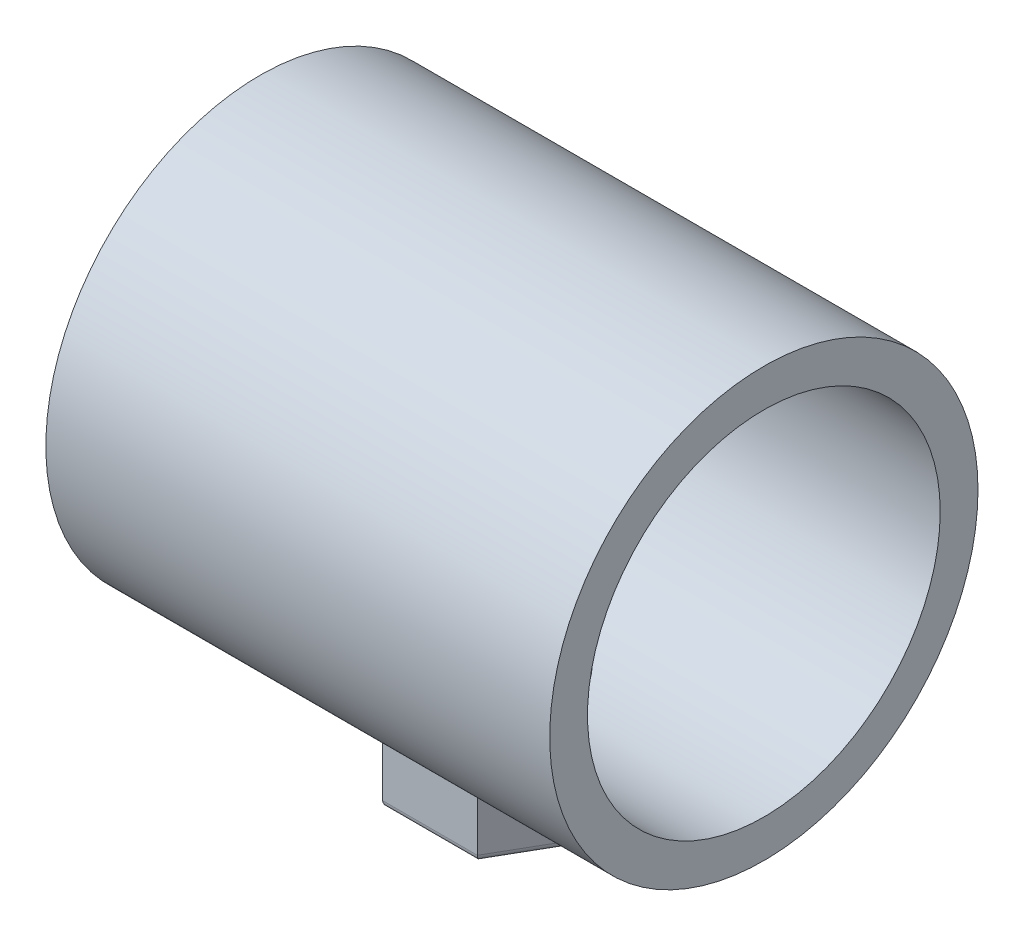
ISO-10303-21;
HEADER;
FILE_DESCRIPTION(('STEP AP214'),'2;1');
FILE_NAME('part.step','',(''),(''),'','','');
FILE_SCHEMA(('AUTOMOTIVE_DESIGN { 1 0 10303 214 1 1 1 1 }'));
ENDSEC;
DATA;
#1=APPLICATION_CONTEXT('core data for automotive mechanical design processes');
#2=APPLICATION_PROTOCOL_DEFINITION('international standard','automotive_design',2000,#1);
#3=PRODUCT_CONTEXT('',#1,'mechanical');
#4=PRODUCT('Part','Part','',(#3));
#5=PRODUCT_RELATED_PRODUCT_CATEGORY('part','',(#4));
#6=PRODUCT_DEFINITION_FORMATION('','',#4);
#7=PRODUCT_DEFINITION_CONTEXT('part definition',#1,'design');
#8=PRODUCT_DEFINITION('design','',#6,#7);
#9=PRODUCT_DEFINITION_SHAPE('','',#8);
#10=(LENGTH_UNIT() NAMED_UNIT(*) SI_UNIT(.MILLI.,.METRE.));
#11=(NAMED_UNIT(*) PLANE_ANGLE_UNIT() SI_UNIT($,.RADIAN.));
#12=(NAMED_UNIT(*) SI_UNIT($,.STERADIAN.) SOLID_ANGLE_UNIT());
#13=UNCERTAINTY_MEASURE_WITH_UNIT(LENGTH_MEASURE(1.E-05),#10,'distance_accuracy_value','');
#14=(GEOMETRIC_REPRESENTATION_CONTEXT(3) GLOBAL_UNCERTAINTY_ASSIGNED_CONTEXT((#13)) GLOBAL_UNIT_ASSIGNED_CONTEXT((#10,
#11,#12)) REPRESENTATION_CONTEXT('',''));
#15=CARTESIAN_POINT('',(0.,0.,0.));
#16=DIRECTION('',(0.,0.,1.));
#17=DIRECTION('',(1.,0.,0.));
#18=AXIS2_PLACEMENT_3D('',#15,#16,#17);
#19=CARTESIAN_POINT('',(23.7583426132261,-17.,6.5));
#20=DIRECTION('',(0.,1.,0.));
#21=DIRECTION('',(0.,0.,1.));
#22=AXIS2_PLACEMENT_3D('',#19,#20,#21);
#23=PLANE('',#22);
#24=DIRECTION('',(-0.498887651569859,0.,0.866666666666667));
#25=VECTOR('',#24,1.);
#26=CARTESIAN_POINT('',(12.9333333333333,-17.,0.249443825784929));
#27=LINE('',#26,#25);
#28=CARTESIAN_POINT('',(16.5307606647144,-17.,-6.));
#29=VERTEX_POINT('',#28);
#30=CARTESIAN_POINT('',(13.0769230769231,-17.,0.));
#31=VERTEX_POINT('',#30);
#32=EDGE_CURVE('E46',#29,#31,#27,.T.);
#33=ORIENTED_EDGE('',*,*,#32,.T.);
#34=DIRECTION('',(0.498887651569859,0.,0.866666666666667));
#35=VECTOR('',#34,1.);
#36=CARTESIAN_POINT('',(16.6749907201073,-17.,6.25055617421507));
#37=LINE('',#36,#35);
#38=CARTESIAN_POINT('',(16.5307606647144,-17.,6.));
#39=VERTEX_POINT('',#38);
#40=EDGE_CURVE('E12',#31,#39,#37,.T.);
#41=ORIENTED_EDGE('',*,*,#40,.T.);
#42=DIRECTION('',(1.,0.,0.));
#43=VECTOR('',#42,1.);
#44=CARTESIAN_POINT('',(23.7583426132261,-17.,6.));
#45=LINE('',#44,#43);
#46=CARTESIAN_POINT('',(23.4692393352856,-17.,6.));
#47=VERTEX_POINT('',#46);
#48=EDGE_CURVE('E160',#39,#47,#45,.T.);
#49=ORIENTED_EDGE('',*,*,#48,.T.);
#50=DIRECTION('',(0.498887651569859,0.,-0.866666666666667));
#51=VECTOR('',#50,1.);
#52=CARTESIAN_POINT('',(27.0666666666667,-17.,-0.249443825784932));
#53=LINE('',#52,#51);
#54=CARTESIAN_POINT('',(26.9230769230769,-17.,0.));
#55=VERTEX_POINT('',#54);
#56=EDGE_CURVE('E238',#47,#55,#53,.T.);
#57=ORIENTED_EDGE('',*,*,#56,.T.);
#58=DIRECTION('',(-0.498887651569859,0.,-0.866666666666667));
#59=VECTOR('',#58,1.);
#60=CARTESIAN_POINT('',(23.3250092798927,-17.,-6.25055617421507));
#61=LINE('',#60,#59);
#62=CARTESIAN_POINT('',(23.4692393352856,-17.,-6.));
#63=VERTEX_POINT('',#62);
#64=EDGE_CURVE('E240',#55,#63,#61,.T.);
#65=ORIENTED_EDGE('',*,*,#64,.T.);
#66=DIRECTION('',(-1.,0.,0.));
#67=VECTOR('',#66,1.);
#68=CARTESIAN_POINT('',(16.2416573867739,-17.,-6.));
#69=LINE('',#68,#67);
#70=EDGE_CURVE('E56',#63,#29,#69,.T.);
#71=ORIENTED_EDGE('',*,*,#70,.T.);
#72=EDGE_LOOP('',(#33,#41,#49,#57,#65,#71));
#73=FACE_BOUND('',#72,.T.);
#74=CARTESIAN_POINT('',(20.,-17.,0.));
#75=DIRECTION('',(0.,1.,0.));
#76=DIRECTION('',(0.,0.,1.));
#77=AXIS2_PLACEMENT_3D('',#74,#75,#76);
#78=CIRCLE('',#77,3.4);
#79=CARTESIAN_POINT('',(20.,-17.,3.4));
#80=VERTEX_POINT('',#79);
#81=EDGE_CURVE('E149',#80,#80,#78,.T.);
#82=ORIENTED_EDGE('',*,*,#81,.F.);
#83=EDGE_LOOP('',(#82));
#84=FACE_BOUND('',#83,.T.);
#85=ADVANCED_FACE('F38',(#73,#84),#23,.T.);
#86=CARTESIAN_POINT('',(23.7583426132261,-22.,6.5));
#87=DIRECTION('',(0.,1.,0.));
#88=DIRECTION('',(0.,0.,1.));
#89=AXIS2_PLACEMENT_3D('',#86,#87,#88);
#90=PLANE('',#89);
#91=DIRECTION('',(1.,0.,0.));
#92=VECTOR('',#91,1.);
#93=CARTESIAN_POINT('',(23.7583426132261,-22.,6.));
#94=LINE('',#93,#92);
#95=CARTESIAN_POINT('',(23.4692393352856,-22.,6.));
#96=VERTEX_POINT('',#95);
#97=CARTESIAN_POINT('',(16.5307606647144,-22.,6.));
#98=VERTEX_POINT('',#97);
#99=EDGE_CURVE('E208',#96,#98,#94,.F.);
#100=ORIENTED_EDGE('',*,*,#99,.T.);
#101=DIRECTION('',(0.498887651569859,0.,0.866666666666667));
#102=VECTOR('',#101,1.);
#103=CARTESIAN_POINT('',(18.5458101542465,-22.,9.50054008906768));
#104=LINE('',#103,#102);
#105=CARTESIAN_POINT('',(13.0769230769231,-22.,0.));
#106=VERTEX_POINT('',#105);
#107=EDGE_CURVE('E218',#98,#106,#104,.F.);
#108=ORIENTED_EDGE('',*,*,#107,.T.);
#109=DIRECTION('',(-0.498887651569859,0.,0.866666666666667));
#110=VECTOR('',#109,1.);
#111=CARTESIAN_POINT('',(12.9250092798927,-22.,0.263904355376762));
#112=LINE('',#111,#110);
#113=CARTESIAN_POINT('',(16.5307606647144,-22.,-5.99999999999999));
#114=VERTEX_POINT('',#113);
#115=EDGE_CURVE('E216',#106,#114,#112,.F.);
#116=ORIENTED_EDGE('',*,*,#115,.T.);
#117=DIRECTION('',(-1.,0.,0.));
#118=VECTOR('',#117,1.);
#119=CARTESIAN_POINT('',(23.7583426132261,-22.,-6.));
#120=LINE('',#119,#118);
#121=CARTESIAN_POINT('',(23.4692393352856,-22.,-5.99999999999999));
#122=VERTEX_POINT('',#121);
#123=EDGE_CURVE('E214',#114,#122,#120,.F.);
#124=ORIENTED_EDGE('',*,*,#123,.T.);
#125=DIRECTION('',(-0.498887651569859,0.,-0.866666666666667));
#126=VECTOR('',#125,1.);
#127=CARTESIAN_POINT('',(28.9458101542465,-22.,3.51388827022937));
#128=LINE('',#127,#126);
#129=CARTESIAN_POINT('',(26.9230769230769,-22.,0.));
#130=VERTEX_POINT('',#129);
#131=EDGE_CURVE('E212',#122,#130,#128,.F.);
#132=ORIENTED_EDGE('',*,*,#131,.T.);
#133=DIRECTION('',(0.498887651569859,0.,-0.866666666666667));
#134=VECTOR('',#133,1.);
#135=CARTESIAN_POINT('',(23.3250092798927,-22.,6.25055617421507));
#136=LINE('',#135,#134);
#137=EDGE_CURVE('E210',#130,#96,#136,.F.);
#138=ORIENTED_EDGE('',*,*,#137,.T.);
#139=EDGE_LOOP('',(#100,#108,#116,#124,#132,#138));
#140=FACE_BOUND('',#139,.T.);
#141=CARTESIAN_POINT('',(20.,-22.,0.));
#142=DIRECTION('',(0.,1.,0.));
#143=DIRECTION('',(0.,0.,1.));
#144=AXIS2_PLACEMENT_3D('',#141,#142,#143);
#145=CIRCLE('',#144,3.4);
#146=CARTESIAN_POINT('',(20.,-22.,3.4));
#147=VERTEX_POINT('',#146);
#148=EDGE_CURVE('E191',#147,#147,#145,.T.);
#149=ORIENTED_EDGE('',*,*,#148,.T.);
#150=EDGE_LOOP('',(#149));
#151=FACE_BOUND('',#150,.T.);
#152=ADVANCED_FACE('F278',(#140,#151),#90,.F.);
#153=CARTESIAN_POINT('',(16.2416573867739,-17.,6.5));
#154=DIRECTION('',(0.,0.,-1.));
#155=DIRECTION('',(-1.,0.,0.));
#156=AXIS2_PLACEMENT_3D('',#153,#154,#155);
#157=PLANE('',#156);
#158=DIRECTION('',(0.,-1.,0.));
#159=VECTOR('',#158,1.);
#160=CARTESIAN_POINT('',(16.2416573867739,-17.,6.5));
#161=LINE('',#160,#159);
#162=CARTESIAN_POINT('',(16.2416573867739,-17.5,6.5));
#163=VERTEX_POINT('',#162);
#164=CARTESIAN_POINT('',(16.2416573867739,-21.5,6.5));
#165=VERTEX_POINT('',#164);
#166=EDGE_CURVE('E128',#163,#165,#161,.T.);
#167=ORIENTED_EDGE('',*,*,#166,.T.);
#168=DIRECTION('',(1.,0.,0.));
#169=VECTOR('',#168,1.);
#170=CARTESIAN_POINT('',(16.2416573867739,-21.5,6.5));
#171=LINE('',#170,#169);
#172=CARTESIAN_POINT('',(23.7583426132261,-21.5,6.5));
#173=VERTEX_POINT('',#172);
#174=EDGE_CURVE('E135',#165,#173,#171,.T.);
#175=ORIENTED_EDGE('',*,*,#174,.T.);
#176=DIRECTION('',(0.,-1.,0.));
#177=VECTOR('',#176,1.);
#178=CARTESIAN_POINT('',(23.7583426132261,-17.,6.5));
#179=LINE('',#178,#177);
#180=CARTESIAN_POINT('',(23.7583426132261,-17.5,6.5));
#181=VERTEX_POINT('',#180);
#182=EDGE_CURVE('E130',#181,#173,#179,.T.);
#183=ORIENTED_EDGE('',*,*,#182,.F.);
#184=DIRECTION('',(1.,0.,0.));
#185=VECTOR('',#184,1.);
#186=CARTESIAN_POINT('',(16.2416573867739,-17.5,6.5));
#187=LINE('',#186,#185);
#188=EDGE_CURVE('E126',#181,#163,#187,.F.);
#189=ORIENTED_EDGE('',*,*,#188,.T.);
#190=EDGE_LOOP('',(#167,#175,#183,#189));
#191=FACE_BOUND('',#190,.T.);
#192=ADVANCED_FACE('F40',(#191),#157,.F.);
#193=CARTESIAN_POINT('',(23.7583426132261,-17.,6.5));
#194=DIRECTION('',(-0.866666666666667,0.,-0.498887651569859));
#195=DIRECTION('',(-0.498887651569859,0.,0.866666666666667));
#196=AXIS2_PLACEMENT_3D('',#193,#194,#195);
#197=PLANE('',#196);
#198=ORIENTED_EDGE('',*,*,#182,.T.);
#199=DIRECTION('',(0.498887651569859,0.,-0.866666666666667));
#200=VECTOR('',#199,1.);
#201=CARTESIAN_POINT('',(23.7583426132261,-21.5,6.5));
#202=LINE('',#201,#200);
#203=CARTESIAN_POINT('',(27.5,-21.5,0.));
#204=VERTEX_POINT('',#203);
#205=EDGE_CURVE('E136',#173,#204,#202,.T.);
#206=ORIENTED_EDGE('',*,*,#205,.T.);
#207=DIRECTION('',(0.,-1.,0.));
#208=VECTOR('',#207,1.);
#209=CARTESIAN_POINT('',(27.5,-17.,0.));
#210=LINE('',#209,#208);
#211=CARTESIAN_POINT('',(27.5,-17.5,0.));
#212=VERTEX_POINT('',#211);
#213=EDGE_CURVE('E203',#212,#204,#210,.T.);
#214=ORIENTED_EDGE('',*,*,#213,.F.);
#215=DIRECTION('',(0.498887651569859,0.,-0.866666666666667));
#216=VECTOR('',#215,1.);
#217=CARTESIAN_POINT('',(23.7583426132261,-17.5,6.5));
#218=LINE('',#217,#216);
#219=EDGE_CURVE('E233',#212,#181,#218,.F.);
#220=ORIENTED_EDGE('',*,*,#219,.T.);
#221=EDGE_LOOP('',(#198,#206,#214,#220));
#222=FACE_BOUND('',#221,.T.);
#223=ADVANCED_FACE('F260',(#222),#197,.F.);
#224=CARTESIAN_POINT('',(23.7583426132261,-17.,-6.5));
#225=DIRECTION('',(-0.866666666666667,0.,0.498887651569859));
#226=DIRECTION('',(0.498887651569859,0.,0.866666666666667));
#227=AXIS2_PLACEMENT_3D('',#224,#225,#226);
#228=PLANE('',#227);
#229=ORIENTED_EDGE('',*,*,#213,.T.);
#230=DIRECTION('',(-0.498887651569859,0.,-0.866666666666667));
#231=VECTOR('',#230,1.);
#232=CARTESIAN_POINT('',(23.7583426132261,-21.5,-6.5));
#233=LINE('',#232,#231);
#234=CARTESIAN_POINT('',(23.7583426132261,-21.5,-6.5));
#235=VERTEX_POINT('',#234);
#236=EDGE_CURVE('E231',#204,#235,#233,.T.);
#237=ORIENTED_EDGE('',*,*,#236,.T.);
#238=DIRECTION('',(0.,-1.,0.));
#239=VECTOR('',#238,1.);
#240=CARTESIAN_POINT('',(23.7583426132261,-17.,-6.5));
#241=LINE('',#240,#239);
#242=CARTESIAN_POINT('',(23.7583426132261,-17.5,-6.5));
#243=VERTEX_POINT('',#242);
#244=EDGE_CURVE('E200',#243,#235,#241,.T.);
#245=ORIENTED_EDGE('',*,*,#244,.F.);
#246=DIRECTION('',(-0.498887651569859,0.,-0.866666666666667));
#247=VECTOR('',#246,1.);
#248=CARTESIAN_POINT('',(27.5,-17.5,0.));
#249=LINE('',#248,#247);
#250=EDGE_CURVE('E229',#243,#212,#249,.F.);
#251=ORIENTED_EDGE('',*,*,#250,.T.);
#252=EDGE_LOOP('',(#229,#237,#245,#251));
#253=FACE_BOUND('',#252,.T.);
#254=ADVANCED_FACE('F264',(#253),#228,.F.);
#255=CARTESIAN_POINT('',(16.2416573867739,-17.,-6.5));
#256=DIRECTION('',(0.,0.,1.));
#257=DIRECTION('',(1.,0.,0.));
#258=AXIS2_PLACEMENT_3D('',#255,#256,#257);
#259=PLANE('',#258);
#260=ORIENTED_EDGE('',*,*,#244,.T.);
#261=DIRECTION('',(-1.,0.,0.));
#262=VECTOR('',#261,1.);
#263=CARTESIAN_POINT('',(16.2416573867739,-21.5,-6.5));
#264=LINE('',#263,#262);
#265=CARTESIAN_POINT('',(16.2416573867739,-21.5,-6.5));
#266=VERTEX_POINT('',#265);
#267=EDGE_CURVE('E227',#235,#266,#264,.T.);
#268=ORIENTED_EDGE('',*,*,#267,.T.);
#269=DIRECTION('',(0.,-1.,0.));
#270=VECTOR('',#269,1.);
#271=CARTESIAN_POINT('',(16.2416573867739,-17.,-6.5));
#272=LINE('',#271,#270);
#273=CARTESIAN_POINT('',(16.2416573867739,-17.5,-6.5));
#274=VERTEX_POINT('',#273);
#275=EDGE_CURVE('E197',#274,#266,#272,.T.);
#276=ORIENTED_EDGE('',*,*,#275,.F.);
#277=DIRECTION('',(-1.,0.,0.));
#278=VECTOR('',#277,1.);
#279=CARTESIAN_POINT('',(23.7583426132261,-17.5,-6.5));
#280=LINE('',#279,#278);
#281=EDGE_CURVE('E225',#274,#243,#280,.F.);
#282=ORIENTED_EDGE('',*,*,#281,.T.);
#283=EDGE_LOOP('',(#260,#268,#276,#282));
#284=FACE_BOUND('',#283,.T.);
#285=ADVANCED_FACE('F288',(#284),#259,.F.);
#286=CARTESIAN_POINT('',(16.2416573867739,-17.,-6.5));
#287=DIRECTION('',(0.866666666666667,0.,0.498887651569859));
#288=DIRECTION('',(0.498887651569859,0.,-0.866666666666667));
#289=AXIS2_PLACEMENT_3D('',#286,#287,#288);
#290=PLANE('',#289);
#291=ORIENTED_EDGE('',*,*,#275,.T.);
#292=DIRECTION('',(-0.498887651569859,0.,0.866666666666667));
#293=VECTOR('',#292,1.);
#294=CARTESIAN_POINT('',(16.2416573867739,-21.5,-6.5));
#295=LINE('',#294,#293);
#296=CARTESIAN_POINT('',(12.5,-21.5,0.));
#297=VERTEX_POINT('',#296);
#298=EDGE_CURVE('E223',#266,#297,#295,.T.);
#299=ORIENTED_EDGE('',*,*,#298,.T.);
#300=DIRECTION('',(0.,-1.,0.));
#301=VECTOR('',#300,1.);
#302=CARTESIAN_POINT('',(12.5,-17.,0.));
#303=LINE('',#302,#301);
#304=CARTESIAN_POINT('',(12.5,-17.5,0.));
#305=VERTEX_POINT('',#304);
#306=EDGE_CURVE('E148',#305,#297,#303,.T.);
#307=ORIENTED_EDGE('',*,*,#306,.F.);
#308=DIRECTION('',(-0.498887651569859,0.,0.866666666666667));
#309=VECTOR('',#308,1.);
#310=CARTESIAN_POINT('',(16.2416573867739,-17.5,-6.5));
#311=LINE('',#310,#309);
#312=EDGE_CURVE('E221',#305,#274,#311,.F.);
#313=ORIENTED_EDGE('',*,*,#312,.T.);
#314=EDGE_LOOP('',(#291,#299,#307,#313));
#315=FACE_BOUND('',#314,.T.);
#316=ADVANCED_FACE('F290',(#315),#290,.F.);
#317=CARTESIAN_POINT('',(16.2416573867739,-17.,6.5));
#318=DIRECTION('',(0.866666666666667,0.,-0.498887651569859));
#319=DIRECTION('',(-0.498887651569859,0.,-0.866666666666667));
#320=AXIS2_PLACEMENT_3D('',#317,#318,#319);
#321=PLANE('',#320);
#322=ORIENTED_EDGE('',*,*,#306,.T.);
#323=DIRECTION('',(0.498887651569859,0.,0.866666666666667));
#324=VECTOR('',#323,1.);
#325=CARTESIAN_POINT('',(16.2416573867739,-21.5,6.5));
#326=LINE('',#325,#324);
#327=EDGE_CURVE('E147',#297,#165,#326,.T.);
#328=ORIENTED_EDGE('',*,*,#327,.T.);
#329=ORIENTED_EDGE('',*,*,#166,.F.);
#330=DIRECTION('',(0.498887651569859,0.,0.866666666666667));
#331=VECTOR('',#330,1.);
#332=CARTESIAN_POINT('',(12.5,-17.5,0.));
#333=LINE('',#332,#331);
#334=EDGE_CURVE('E144',#163,#305,#333,.F.);
#335=ORIENTED_EDGE('',*,*,#334,.T.);
#336=EDGE_LOOP('',(#322,#328,#329,#335));
#337=FACE_BOUND('',#336,.T.);
#338=ADVANCED_FACE('F143',(#337),#321,.F.);
#339=CARTESIAN_POINT('',(20.,-17.,0.));
#340=DIRECTION('',(0.,-1.,0.));
#341=DIRECTION('',(0.,0.,-1.));
#342=AXIS2_PLACEMENT_3D('',#339,#340,#341);
#343=CYLINDRICAL_SURFACE('',#342,3.4);
#344=ORIENTED_EDGE('',*,*,#81,.T.);
#345=EDGE_LOOP('',(#344));
#346=FACE_BOUND('',#345,.T.);
#347=ORIENTED_EDGE('',*,*,#148,.F.);
#348=EDGE_LOOP('',(#347));
#349=FACE_BOUND('',#348,.T.);
#350=ADVANCED_FACE('F319',(#346,#349),#343,.F.);
#351=CARTESIAN_POINT('',(23.3250092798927,-21.5,-6.25055617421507));
#352=DIRECTION('',(-0.498887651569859,0.,-0.866666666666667));
#353=DIRECTION('',(-0.866666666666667,0.,0.498887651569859));
#354=AXIS2_PLACEMENT_3D('',#351,#352,#353);
#355=CYLINDRICAL_SURFACE('',#354,0.5);
#356=CARTESIAN_POINT('',(26.9230769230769,-21.5,0.));
#357=DIRECTION('',(0.,0.,-1.));
#358=DIRECTION('',(1.,0.,0.));
#359=AXIS2_PLACEMENT_3D('',#356,#357,#358);
#360=ELLIPSE('',#359,0.576923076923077,0.5);
#361=EDGE_CURVE('E185',#130,#204,#360,.F.);
#362=ORIENTED_EDGE('',*,*,#361,.F.);
#363=ORIENTED_EDGE('',*,*,#131,.F.);
#364=CARTESIAN_POINT('',(23.4692393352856,-21.5,-5.99999999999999));
#365=DIRECTION('',(-0.865704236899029,0.,-0.500555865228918));
#366=DIRECTION('',(0.500555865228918,0.,-0.865704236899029));
#367=AXIS2_PLACEMENT_3D('',#364,#365,#366);
#368=ELLIPSE('',#367,0.577564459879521,0.5);
#369=EDGE_CURVE('E188',#235,#122,#368,.T.);
#370=ORIENTED_EDGE('',*,*,#369,.F.);
#371=ORIENTED_EDGE('',*,*,#236,.F.);
#372=EDGE_LOOP('',(#362,#363,#370,#371));
#373=FACE_BOUND('',#372,.T.);
#374=ADVANCED_FACE('F269',(#373),#355,.T.);
#375=CARTESIAN_POINT('',(16.2416573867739,-21.5,-5.99999999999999));
#376=DIRECTION('',(-1.,0.,0.));
#377=DIRECTION('',(0.,0.,1.));
#378=AXIS2_PLACEMENT_3D('',#375,#376,#377);
#379=CYLINDRICAL_SURFACE('',#378,0.5);
#380=ORIENTED_EDGE('',*,*,#369,.T.);
#381=ORIENTED_EDGE('',*,*,#123,.F.);
#382=CARTESIAN_POINT('',(16.5307606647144,-21.5,-5.99999999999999));
#383=DIRECTION('',(-0.865704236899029,0.,0.500555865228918));
#384=DIRECTION('',(-0.500555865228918,0.,-0.865704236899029));
#385=AXIS2_PLACEMENT_3D('',#382,#383,#384);
#386=ELLIPSE('',#385,0.577564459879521,0.5);
#387=EDGE_CURVE('E182',#266,#114,#386,.T.);
#388=ORIENTED_EDGE('',*,*,#387,.F.);
#389=ORIENTED_EDGE('',*,*,#267,.F.);
#390=EDGE_LOOP('',(#380,#381,#388,#389));
#391=FACE_BOUND('',#390,.T.);
#392=ADVANCED_FACE('F283',(#391),#379,.T.);
#393=CARTESIAN_POINT('',(23.3250092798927,-21.5,6.25055617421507));
#394=DIRECTION('',(0.498887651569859,0.,-0.866666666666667));
#395=DIRECTION('',(-0.866666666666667,0.,-0.498887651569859));
#396=AXIS2_PLACEMENT_3D('',#393,#394,#395);
#397=CYLINDRICAL_SURFACE('',#396,0.5);
#398=ORIENTED_EDGE('',*,*,#361,.T.);
#399=ORIENTED_EDGE('',*,*,#205,.F.);
#400=CARTESIAN_POINT('',(23.4692393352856,-21.5,6.));
#401=DIRECTION('',(0.865704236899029,0.,-0.500555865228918));
#402=DIRECTION('',(0.500555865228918,0.,0.865704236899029));
#403=AXIS2_PLACEMENT_3D('',#400,#401,#402);
#404=ELLIPSE('',#403,0.577564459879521,0.5);
#405=EDGE_CURVE('E179',#96,#173,#404,.F.);
#406=ORIENTED_EDGE('',*,*,#405,.F.);
#407=ORIENTED_EDGE('',*,*,#137,.F.);
#408=EDGE_LOOP('',(#398,#399,#406,#407));
#409=FACE_BOUND('',#408,.T.);
#410=ADVANCED_FACE('F274',(#409),#397,.T.);
#411=CARTESIAN_POINT('',(16.6749907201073,-21.5,-6.25055617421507));
#412=DIRECTION('',(-0.498887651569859,0.,0.866666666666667));
#413=DIRECTION('',(0.866666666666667,0.,0.498887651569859));
#414=AXIS2_PLACEMENT_3D('',#411,#412,#413);
#415=CYLINDRICAL_SURFACE('',#414,0.5);
#416=ORIENTED_EDGE('',*,*,#387,.T.);
#417=ORIENTED_EDGE('',*,*,#115,.F.);
#418=CARTESIAN_POINT('',(13.0769230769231,-21.5,0.));
#419=DIRECTION('',(0.,0.,1.));
#420=DIRECTION('',(-1.,0.,0.));
#421=AXIS2_PLACEMENT_3D('',#418,#419,#420);
#422=ELLIPSE('',#421,0.576923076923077,0.5);
#423=EDGE_CURVE('E177',#297,#106,#422,.T.);
#424=ORIENTED_EDGE('',*,*,#423,.F.);
#425=ORIENTED_EDGE('',*,*,#298,.F.);
#426=EDGE_LOOP('',(#416,#417,#424,#425));
#427=FACE_BOUND('',#426,.T.);
#428=ADVANCED_FACE('F294',(#427),#415,.T.);
#429=CARTESIAN_POINT('',(16.2416573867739,-21.5,6.));
#430=DIRECTION('',(1.,0.,0.));
#431=DIRECTION('',(0.,0.,-1.));
#432=AXIS2_PLACEMENT_3D('',#429,#430,#431);
#433=CYLINDRICAL_SURFACE('',#432,0.5);
#434=ORIENTED_EDGE('',*,*,#405,.T.);
#435=ORIENTED_EDGE('',*,*,#174,.F.);
#436=CARTESIAN_POINT('',(16.5307606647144,-21.5,6.));
#437=DIRECTION('',(0.865704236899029,0.,0.500555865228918));
#438=DIRECTION('',(0.500555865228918,0.,-0.865704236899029));
#439=AXIS2_PLACEMENT_3D('',#436,#437,#438);
#440=ELLIPSE('',#439,0.577564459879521,0.5);
#441=EDGE_CURVE('E175',#98,#165,#440,.F.);
#442=ORIENTED_EDGE('',*,*,#441,.F.);
#443=ORIENTED_EDGE('',*,*,#99,.F.);
#444=EDGE_LOOP('',(#434,#435,#442,#443));
#445=FACE_BOUND('',#444,.T.);
#446=ADVANCED_FACE('F300',(#445),#433,.T.);
#447=CARTESIAN_POINT('',(16.6749907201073,-21.5,6.25055617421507));
#448=DIRECTION('',(0.498887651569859,0.,0.866666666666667));
#449=DIRECTION('',(0.866666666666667,0.,-0.498887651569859));
#450=AXIS2_PLACEMENT_3D('',#447,#448,#449);
#451=CYLINDRICAL_SURFACE('',#450,0.5);
#452=ORIENTED_EDGE('',*,*,#423,.T.);
#453=ORIENTED_EDGE('',*,*,#107,.F.);
#454=ORIENTED_EDGE('',*,*,#441,.T.);
#455=ORIENTED_EDGE('',*,*,#327,.F.);
#456=EDGE_LOOP('',(#452,#453,#454,#455));
#457=FACE_BOUND('',#456,.T.);
#458=ADVANCED_FACE('F296',(#457),#451,.T.);
#459=CARTESIAN_POINT('',(28.9458101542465,-17.5,3.51388827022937));
#460=DIRECTION('',(0.498887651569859,0.,0.866666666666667));
#461=DIRECTION('',(0.866666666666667,0.,-0.498887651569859));
#462=AXIS2_PLACEMENT_3D('',#459,#460,#461);
#463=CYLINDRICAL_SURFACE('',#462,0.5);
#464=CARTESIAN_POINT('',(26.9230769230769,-17.5,0.));
#465=DIRECTION('',(0.,0.,1.));
#466=DIRECTION('',(-1.,0.,0.));
#467=AXIS2_PLACEMENT_3D('',#464,#465,#466);
#468=ELLIPSE('',#467,0.576923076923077,0.5);
#469=EDGE_CURVE('E169',#212,#55,#468,.T.);
#470=ORIENTED_EDGE('',*,*,#469,.F.);
#471=ORIENTED_EDGE('',*,*,#250,.F.);
#472=CARTESIAN_POINT('',(23.4692393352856,-17.5,-6.));
#473=DIRECTION('',(0.865704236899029,0.,0.500555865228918));
#474=DIRECTION('',(-0.500555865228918,0.,0.865704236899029));
#475=AXIS2_PLACEMENT_3D('',#472,#473,#474);
#476=ELLIPSE('',#475,0.577564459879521,0.5);
#477=EDGE_CURVE('E172',#63,#243,#476,.F.);
#478=ORIENTED_EDGE('',*,*,#477,.F.);
#479=ORIENTED_EDGE('',*,*,#64,.F.);
#480=EDGE_LOOP('',(#470,#471,#478,#479));
#481=FACE_BOUND('',#480,.T.);
#482=ADVANCED_FACE('F249',(#481),#463,.T.);
#483=CARTESIAN_POINT('',(23.7583426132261,-17.5,-6.));
#484=DIRECTION('',(1.,0.,0.));
#485=DIRECTION('',(0.,0.,-1.));
#486=AXIS2_PLACEMENT_3D('',#483,#484,#485);
#487=CYLINDRICAL_SURFACE('',#486,0.5);
#488=ORIENTED_EDGE('',*,*,#477,.T.);
#489=ORIENTED_EDGE('',*,*,#281,.F.);
#490=CARTESIAN_POINT('',(16.5307606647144,-17.5,-6.));
#491=DIRECTION('',(0.865704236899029,0.,-0.500555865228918));
#492=DIRECTION('',(0.500555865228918,0.,0.865704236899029));
#493=AXIS2_PLACEMENT_3D('',#490,#491,#492);
#494=ELLIPSE('',#493,0.577564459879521,0.5);
#495=EDGE_CURVE('E166',#29,#274,#494,.F.);
#496=ORIENTED_EDGE('',*,*,#495,.F.);
#497=ORIENTED_EDGE('',*,*,#70,.F.);
#498=EDGE_LOOP('',(#488,#489,#496,#497));
#499=FACE_BOUND('',#498,.T.);
#500=ADVANCED_FACE('F252',(#499),#487,.T.);
#501=CARTESIAN_POINT('',(23.3250092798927,-17.5,6.25055617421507));
#502=DIRECTION('',(-0.498887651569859,0.,0.866666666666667));
#503=DIRECTION('',(0.866666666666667,0.,0.498887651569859));
#504=AXIS2_PLACEMENT_3D('',#501,#502,#503);
#505=CYLINDRICAL_SURFACE('',#504,0.5);
#506=ORIENTED_EDGE('',*,*,#469,.T.);
#507=ORIENTED_EDGE('',*,*,#56,.F.);
#508=CARTESIAN_POINT('',(23.4692393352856,-17.5,6.));
#509=DIRECTION('',(-0.865704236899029,0.,0.500555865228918));
#510=DIRECTION('',(-0.500555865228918,0.,-0.865704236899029));
#511=AXIS2_PLACEMENT_3D('',#508,#509,#510);
#512=ELLIPSE('',#511,0.577564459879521,0.5);
#513=EDGE_CURVE('E162',#181,#47,#512,.T.);
#514=ORIENTED_EDGE('',*,*,#513,.F.);
#515=ORIENTED_EDGE('',*,*,#219,.F.);
#516=EDGE_LOOP('',(#506,#507,#514,#515));
#517=FACE_BOUND('',#516,.T.);
#518=ADVANCED_FACE('F256',(#517),#505,.T.);
#519=CARTESIAN_POINT('',(12.9250092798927,-17.5,0.263904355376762));
#520=DIRECTION('',(0.498887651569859,0.,-0.866666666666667));
#521=DIRECTION('',(-0.866666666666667,0.,-0.498887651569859));
#522=AXIS2_PLACEMENT_3D('',#519,#520,#521);
#523=CYLINDRICAL_SURFACE('',#522,0.5);
#524=ORIENTED_EDGE('',*,*,#495,.T.);
#525=ORIENTED_EDGE('',*,*,#312,.F.);
#526=CARTESIAN_POINT('',(13.0769230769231,-17.5,0.));
#527=DIRECTION('',(0.,0.,-1.));
#528=DIRECTION('',(1.,0.,0.));
#529=AXIS2_PLACEMENT_3D('',#526,#527,#528);
#530=ELLIPSE('',#529,0.576923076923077,0.5);
#531=EDGE_CURVE('E156',#31,#305,#530,.F.);
#532=ORIENTED_EDGE('',*,*,#531,.F.);
#533=ORIENTED_EDGE('',*,*,#32,.F.);
#534=EDGE_LOOP('',(#524,#525,#532,#533));
#535=FACE_BOUND('',#534,.T.);
#536=ADVANCED_FACE('F254',(#535),#523,.T.);
#537=CARTESIAN_POINT('',(23.7583426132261,-17.5,6.));
#538=DIRECTION('',(-1.,0.,0.));
#539=DIRECTION('',(0.,0.,1.));
#540=AXIS2_PLACEMENT_3D('',#537,#538,#539);
#541=CYLINDRICAL_SURFACE('',#540,0.5);
#542=ORIENTED_EDGE('',*,*,#513,.T.);
#543=ORIENTED_EDGE('',*,*,#48,.F.);
#544=CARTESIAN_POINT('',(16.5307606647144,-17.5,6.));
#545=DIRECTION('',(-0.865704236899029,0.,-0.500555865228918));
#546=DIRECTION('',(-0.500555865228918,0.,0.865704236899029));
#547=AXIS2_PLACEMENT_3D('',#544,#545,#546);
#548=ELLIPSE('',#547,0.577564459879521,0.5);
#549=EDGE_CURVE('E154',#163,#39,#548,.T.);
#550=ORIENTED_EDGE('',*,*,#549,.F.);
#551=ORIENTED_EDGE('',*,*,#188,.F.);
#552=EDGE_LOOP('',(#542,#543,#550,#551));
#553=FACE_BOUND('',#552,.T.);
#554=ADVANCED_FACE('F159',(#553),#541,.T.);
#555=CARTESIAN_POINT('',(18.5458101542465,-17.5,9.50054008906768));
#556=DIRECTION('',(-0.498887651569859,0.,-0.866666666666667));
#557=DIRECTION('',(-0.866666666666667,0.,0.498887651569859));
#558=AXIS2_PLACEMENT_3D('',#555,#556,#557);
#559=CYLINDRICAL_SURFACE('',#558,0.5);
#560=ORIENTED_EDGE('',*,*,#531,.T.);
#561=ORIENTED_EDGE('',*,*,#334,.F.);
#562=ORIENTED_EDGE('',*,*,#549,.T.);
#563=ORIENTED_EDGE('',*,*,#40,.F.);
#564=EDGE_LOOP('',(#560,#561,#562,#563));
#565=FACE_BOUND('',#564,.T.);
#566=ADVANCED_FACE('F152',(#565),#559,.T.);
#567=CLOSED_SHELL('',(#85,#152,#192,#223,#254,#285,#316,#338,#350,#374,#392,#410,#428,#446,#458,
#482,#500,#518,#536,#554,#566));
#568=MANIFOLD_SOLID_BREP('B2',#567);
#569=CARTESIAN_POINT('',(40.,0.,0.));
#570=DIRECTION('',(1.,0.,0.));
#571=DIRECTION('',(0.,0.,-1.));
#572=AXIS2_PLACEMENT_3D('',#569,#570,#571);
#573=PLANE('',#572);
#574=CARTESIAN_POINT('',(40.,0.,0.));
#575=DIRECTION('',(1.,0.,0.));
#576=DIRECTION('',(0.,0.,-1.));
#577=AXIS2_PLACEMENT_3D('',#574,#575,#576);
#578=CIRCLE('',#577,17.);
#579=CARTESIAN_POINT('',(40.,0.,-17.));
#580=VERTEX_POINT('',#579);
#581=EDGE_CURVE('E37',#580,#580,#578,.T.);
#582=ORIENTED_EDGE('',*,*,#581,.T.);
#583=EDGE_LOOP('',(#582));
#584=FACE_BOUND('',#583,.T.);
#585=CARTESIAN_POINT('',(40.,0.,0.));
#586=DIRECTION('',(1.,0.,0.));
#587=DIRECTION('',(0.,0.,-1.));
#588=AXIS2_PLACEMENT_3D('',#585,#586,#587);
#589=CIRCLE('',#588,14.);
#590=CARTESIAN_POINT('',(40.,0.,-14.));
#591=VERTEX_POINT('',#590);
#592=EDGE_CURVE('E486',#591,#591,#589,.T.);
#593=ORIENTED_EDGE('',*,*,#592,.F.);
#594=EDGE_LOOP('',(#593));
#595=FACE_BOUND('',#594,.T.);
#596=ADVANCED_FACE('F475',(#584,#595),#573,.T.);
#597=CARTESIAN_POINT('',(0.,0.,0.));
#598=DIRECTION('',(1.,0.,0.));
#599=DIRECTION('',(0.,0.,-1.));
#600=AXIS2_PLACEMENT_3D('',#597,#598,#599);
#601=PLANE('',#600);
#602=CARTESIAN_POINT('',(0.,0.,0.));
#603=DIRECTION('',(1.,0.,0.));
#604=DIRECTION('',(0.,0.,-1.));
#605=AXIS2_PLACEMENT_3D('',#602,#603,#604);
#606=CIRCLE('',#605,17.);
#607=CARTESIAN_POINT('',(0.,0.,-17.));
#608=VERTEX_POINT('',#607);
#609=EDGE_CURVE('E482',#608,#608,#606,.T.);
#610=ORIENTED_EDGE('',*,*,#609,.F.);
#611=EDGE_LOOP('',(#610));
#612=FACE_BOUND('',#611,.T.);
#613=CARTESIAN_POINT('',(0.,0.,0.));
#614=DIRECTION('',(1.,0.,0.));
#615=DIRECTION('',(0.,0.,-1.));
#616=AXIS2_PLACEMENT_3D('',#613,#614,#615);
#617=CIRCLE('',#616,14.);
#618=CARTESIAN_POINT('',(0.,0.,-14.));
#619=VERTEX_POINT('',#618);
#620=EDGE_CURVE('E490',#619,#619,#617,.T.);
#621=ORIENTED_EDGE('',*,*,#620,.T.);
#622=EDGE_LOOP('',(#621));
#623=FACE_BOUND('',#622,.T.);
#624=ADVANCED_FACE('F518',(#612,#623),#601,.F.);
#625=CARTESIAN_POINT('',(40.,0.,0.));
#626=DIRECTION('',(-1.,0.,0.));
#627=DIRECTION('',(0.,0.,1.));
#628=AXIS2_PLACEMENT_3D('',#625,#626,#627);
#629=CYLINDRICAL_SURFACE('',#628,17.);
#630=CARTESIAN_POINT('',(20.,-16.393596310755,4.5));
#631=CARTESIAN_POINT('',(19.7520319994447,-16.3936006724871,4.49999388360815));
#632=CARTESIAN_POINT('',(19.5039989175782,-16.3992839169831,4.47943413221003));
#633=CARTESIAN_POINT('',(19.0150910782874,-16.4213360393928,4.397891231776));
#634=CARTESIAN_POINT('',(18.7742200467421,-16.4377103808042,4.33688741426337));
#635=CARTESIAN_POINT('',(18.3067795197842,-16.4791631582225,4.17659815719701));
#636=CARTESIAN_POINT('',(18.0801906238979,-16.504229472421,4.07736600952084));
#637=CARTESIAN_POINT('',(17.6468426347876,-16.5602264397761,3.84360332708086));
#638=CARTESIAN_POINT('',(17.4400850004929,-16.5911575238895,3.70907019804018));
#639=CARTESIAN_POINT('',(17.0471721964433,-16.6562530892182,3.40497903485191));
#640=CARTESIAN_POINT('',(16.861578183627,-16.6904742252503,3.23470791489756));
#641=CARTESIAN_POINT('',(16.5212195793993,-16.7578047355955,2.8655080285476));
#642=CARTESIAN_POINT('',(16.3664581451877,-16.7909139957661,2.66657633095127));
#643=CARTESIAN_POINT('',(16.0898231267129,-16.8529217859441,2.24181677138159));
#644=CARTESIAN_POINT('',(15.9685066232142,-16.8817456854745,2.01561425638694));
#645=CARTESIAN_POINT('',(15.7658369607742,-16.9312854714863,1.54513342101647));
#646=CARTESIAN_POINT('',(15.6844771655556,-16.9520027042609,1.30085811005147));
#647=CARTESIAN_POINT('',(15.5658443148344,-16.9825942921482,0.807022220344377));
#648=CARTESIAN_POINT('',(15.5276168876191,-16.9927030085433,0.557705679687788));
#649=CARTESIAN_POINT('',(15.4933321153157,-17.0017576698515,0.0560069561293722));
#650=CARTESIAN_POINT('',(15.4972678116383,-17.0007054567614,-0.196374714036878));
#651=CARTESIAN_POINT('',(15.5465237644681,-16.9877288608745,-0.690399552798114));
#652=CARTESIAN_POINT('',(15.590813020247,-16.9760753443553,-0.932153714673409));
#653=CARTESIAN_POINT('',(15.7178542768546,-16.9435246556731,-1.40466802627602));
#654=CARTESIAN_POINT('',(15.8006084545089,-16.9226269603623,-1.63542755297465));
#655=CARTESIAN_POINT('',(16.0030259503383,-16.8735327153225,-2.08204430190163));
#656=CARTESIAN_POINT('',(16.123044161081,-16.8452664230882,-2.29773269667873));
#657=CARTESIAN_POINT('',(16.3963108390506,-16.7844830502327,-2.70626074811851));
#658=CARTESIAN_POINT('',(16.5495657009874,-16.7519651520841,-2.89909599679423));
#659=CARTESIAN_POINT('',(16.890434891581,-16.685043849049,-3.2625971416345));
#660=CARTESIAN_POINT('',(17.0789486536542,-16.6506131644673,-3.43241555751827));
#661=CARTESIAN_POINT('',(17.4821357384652,-16.5846362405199,-3.73823274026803));
#662=CARTESIAN_POINT('',(17.6968106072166,-16.5530901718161,-3.87422950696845));
#663=CARTESIAN_POINT('',(18.1480425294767,-16.4963462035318,-4.10917557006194));
#664=CARTESIAN_POINT('',(18.3847231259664,-16.4711875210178,-4.20789772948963));
#665=CARTESIAN_POINT('',(18.8721538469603,-16.4305559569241,-4.3638743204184));
#666=CARTESIAN_POINT('',(19.1229005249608,-16.4150807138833,-4.42113886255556));
#667=CARTESIAN_POINT('',(19.6234278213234,-16.3960703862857,-4.49112033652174));
#668=CARTESIAN_POINT('',(19.8730192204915,-16.3921969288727,-4.50510011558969));
#669=CARTESIAN_POINT('',(20.3709727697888,-16.3959035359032,-4.49159193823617));
#670=CARTESIAN_POINT('',(20.6193350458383,-16.4034824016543,-4.46410832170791));
#671=CARTESIAN_POINT('',(21.1029359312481,-16.4289131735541,-4.36956609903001));
#672=CARTESIAN_POINT('',(21.3383337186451,-16.4465686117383,-4.30326374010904));
#673=CARTESIAN_POINT('',(21.7946684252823,-16.4899719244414,-4.13381499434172));
#674=CARTESIAN_POINT('',(22.015603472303,-16.5157208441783,-4.03066384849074));
#675=CARTESIAN_POINT('',(22.442032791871,-16.5731065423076,-3.7878722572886));
#676=CARTESIAN_POINT('',(22.6470879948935,-16.6048589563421,-3.64748860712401));
#677=CARTESIAN_POINT('',(23.0311944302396,-16.6704004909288,-3.33514046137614));
#678=CARTESIAN_POINT('',(23.2102408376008,-16.7041899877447,-3.16317011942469));
#679=CARTESIAN_POINT('',(23.5424741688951,-16.7711611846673,-2.78669446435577));
#680=CARTESIAN_POINT('',(23.6947812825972,-16.8042983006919,-2.58140323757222));
#681=CARTESIAN_POINT('',(23.9627707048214,-16.8652443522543,-2.14743357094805));
#682=CARTESIAN_POINT('',(24.0784549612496,-16.8930535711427,-1.91875637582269));
#683=CARTESIAN_POINT('',(24.2688588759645,-16.9400315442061,-1.44611445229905));
#684=CARTESIAN_POINT('',(24.3438833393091,-16.9592643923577,-1.20227919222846));
#685=CARTESIAN_POINT('',(24.4517264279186,-16.9872045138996,-0.704878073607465));
#686=CARTESIAN_POINT('',(24.4845542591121,-16.9959140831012,-0.451314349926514));
#687=CARTESIAN_POINT('',(24.5065025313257,-17.0017196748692,0.0501209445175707));
#688=CARTESIAN_POINT('',(24.4969144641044,-16.9991588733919,0.29793281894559));
#689=CARTESIAN_POINT('',(24.4372969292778,-16.9834857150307,0.788283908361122));
#690=CARTESIAN_POINT('',(24.387268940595,-16.9703737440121,1.03082331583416));
#691=CARTESIAN_POINT('',(24.2489175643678,-16.9351378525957,1.50221539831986));
#692=CARTESIAN_POINT('',(24.1608527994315,-16.9130748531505,1.73114883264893));
#693=CARTESIAN_POINT('',(23.9491589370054,-16.862245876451,2.17112097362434));
#694=CARTESIAN_POINT('',(23.8255249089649,-16.8334789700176,2.38215719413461));
#695=CARTESIAN_POINT('',(23.5424029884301,-16.7713770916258,2.78637061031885));
#696=CARTESIAN_POINT('',(23.3820563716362,-16.7379417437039,2.97893087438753));
#697=CARTESIAN_POINT('',(23.0316942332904,-16.6706828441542,3.33484796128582));
#698=CARTESIAN_POINT('',(22.8416709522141,-16.6368591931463,3.49819712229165));
#699=CARTESIAN_POINT('',(22.4324157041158,-16.5718139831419,3.79454165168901));
#700=CARTESIAN_POINT('',(22.2126419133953,-16.5406643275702,3.92680592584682));
#701=CARTESIAN_POINT('',(21.7531796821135,-16.4855031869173,4.15231897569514));
#702=CARTESIAN_POINT('',(21.5135045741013,-16.4614869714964,4.24559362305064));
#703=CARTESIAN_POINT('',(21.0622127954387,-16.4266974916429,4.37806512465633));
#704=CARTESIAN_POINT('',(20.8525780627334,-16.4143841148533,4.42368429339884));
#705=CARTESIAN_POINT('',(20.4286447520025,-16.3978320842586,4.48465270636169));
#706=CARTESIAN_POINT('',(20.2143466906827,-16.3935925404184,4.50000528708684));
#707=CARTESIAN_POINT('',(20.,-16.393596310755,4.5));
#708=B_SPLINE_CURVE_WITH_KNOTS('',3,(#630,#631,#632,#633,#634,#635,#636,#637,#638,#639,#640,
#641,#642,#643,#644,#645,#646,#647,#648,#649,#650,#651,#652,#653,#654,#655,#656,#657,#658,#659,
#660,#661,#662,#663,#664,#665,#666,#667,#668,#669,#670,#671,#672,#673,#674,#675,#676,#677,#678,
#679,#680,#681,#682,#683,#684,#685,#686,#687,#688,#689,#690,#691,#692,#693,#694,#695,#696,#697,
#698,#699,#700,#701,#702,#703,#704,#705,#706,#707),.UNSPECIFIED.,.T.,.F.,(4,2,2,2,2,2,2,2,2,2,2,
2,2,2,2,2,2,2,2,2,2,2,2,2,2,2,2,2,2,2,2,2,2,2,2,2,2,2,4),(0.,0.74311594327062,1.48661194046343,
2.2290752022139,2.97159304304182,3.73064172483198,4.48976809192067,5.26086490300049,
6.03183360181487,6.78538667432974,7.53881538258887,8.27351841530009,9.00826303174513,
9.75023169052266,10.4923432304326,11.2569124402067,12.0215268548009,12.7907280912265,
13.5597416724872,14.3060968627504,15.0523739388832,15.7845746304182,16.5168699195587,
17.2650550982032,18.0133788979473,18.782975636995,19.5525314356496,20.3162355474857,
21.0797730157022,21.8202247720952,22.5606494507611,23.2961171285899,24.0316868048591,
24.7866341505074,25.5417792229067,26.3132200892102,27.0841482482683,27.7265779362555,
28.3689368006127),.UNSPECIFIED.);
#709=CARTESIAN_POINT('',(20.,-16.393596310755,4.5));
#710=VERTEX_POINT('',#709);
#711=EDGE_CURVE('E495',#710,#710,#708,.T.);
#712=ORIENTED_EDGE('',*,*,#711,.F.);
#713=EDGE_LOOP('',(#712));
#714=FACE_BOUND('',#713,.T.);
#715=ORIENTED_EDGE('',*,*,#581,.F.);
#716=EDGE_LOOP('',(#715));
#717=FACE_BOUND('',#716,.T.);
#718=ORIENTED_EDGE('',*,*,#609,.T.);
#719=EDGE_LOOP('',(#718));
#720=FACE_BOUND('',#719,.T.);
#721=ADVANCED_FACE('F477',(#714,#717,#720),#629,.T.);
#722=CARTESIAN_POINT('',(40.,0.,0.));
#723=DIRECTION('',(-1.,0.,0.));
#724=DIRECTION('',(0.,0.,1.));
#725=AXIS2_PLACEMENT_3D('',#722,#723,#724);
#726=CYLINDRICAL_SURFACE('',#725,14.);
#727=CARTESIAN_POINT('',(20.,-13.2570735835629,4.5));
#728=CARTESIAN_POINT('',(19.7543466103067,-13.2570742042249,4.49999946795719));
#729=CARTESIAN_POINT('',(19.5086863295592,-13.2639761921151,4.47981662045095));
#730=CARTESIAN_POINT('',(19.0246086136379,-13.2907074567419,4.39986672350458));
#731=CARTESIAN_POINT('',(18.7861928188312,-13.3105396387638,4.34009077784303));
#732=CARTESIAN_POINT('',(18.3236893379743,-13.360657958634,4.18324301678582));
#733=CARTESIAN_POINT('',(18.0995760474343,-13.39092475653,4.08624016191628));
#734=CARTESIAN_POINT('',(17.6707376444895,-13.4584746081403,3.85792459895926));
#735=CARTESIAN_POINT('',(17.4660163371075,-13.4957590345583,3.72660517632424));
#736=CARTESIAN_POINT('',(17.0743300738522,-13.5746634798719,3.42827051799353));
#737=CARTESIAN_POINT('',(16.8881735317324,-13.6163859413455,3.26022074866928));
#738=CARTESIAN_POINT('',(16.5461393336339,-13.698596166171,2.89540695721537));
#739=CARTESIAN_POINT('',(16.3902661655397,-13.7390837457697,2.69863868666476));
#740=CARTESIAN_POINT('',(16.1096137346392,-13.8154401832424,2.27612095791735));
#741=CARTESIAN_POINT('',(15.9856731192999,-13.8511744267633,2.04978796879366));
#742=CARTESIAN_POINT('',(15.7779371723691,-13.9127971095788,1.57814320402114));
#743=CARTESIAN_POINT('',(15.6941318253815,-13.9386880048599,1.33283618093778));
#744=CARTESIAN_POINT('',(15.5717623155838,-13.9769814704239,0.838676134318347));
#745=CARTESIAN_POINT('',(15.5318151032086,-13.9897954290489,0.590198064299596));
#746=CARTESIAN_POINT('',(15.4939072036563,-14.0019472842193,0.0897577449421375));
#747=CARTESIAN_POINT('',(15.4959364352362,-14.001288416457,-0.16220365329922));
#748=CARTESIAN_POINT('',(15.5410277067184,-13.9868520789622,-0.6527010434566));
#749=CARTESIAN_POINT('',(15.5825892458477,-13.9735543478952,-0.891391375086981));
#750=CARTESIAN_POINT('',(15.7030951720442,-13.93592963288,-1.35820946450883));
#751=CARTESIAN_POINT('',(15.7820420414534,-13.9116019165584,-1.58633651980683));
#752=CARTESIAN_POINT('',(15.9760042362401,-13.8540207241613,-2.02893780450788));
#753=CARTESIAN_POINT('',(16.0914628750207,-13.8206583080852,-2.24320300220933));
#754=CARTESIAN_POINT('',(16.3548115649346,-13.7485050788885,-2.64977463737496));
#755=CARTESIAN_POINT('',(16.5027101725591,-13.7097128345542,-2.84207526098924));
#756=CARTESIAN_POINT('',(16.834384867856,-13.628799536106,-3.20819824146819));
#757=CARTESIAN_POINT('',(17.0194523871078,-13.5866071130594,-3.38083656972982));
#758=CARTESIAN_POINT('',(17.4162923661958,-13.5051063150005,-3.69299291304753));
#759=CARTESIAN_POINT('',(17.6280683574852,-13.4657983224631,-3.83250654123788));
#760=CARTESIAN_POINT('',(18.075829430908,-13.3941437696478,-4.0759392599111));
#761=CARTESIAN_POINT('',(18.3120827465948,-13.3618898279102,-4.17939428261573));
#762=CARTESIAN_POINT('',(18.7999484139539,-13.3090749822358,-4.34466789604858));
#763=CARTESIAN_POINT('',(19.0515548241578,-13.2885095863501,-4.40650248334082));
#764=CARTESIAN_POINT('',(19.5515869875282,-13.262405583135,-4.48444267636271));
#765=CARTESIAN_POINT('',(19.7996975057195,-13.2562684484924,-4.50237103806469));
#766=CARTESIAN_POINT('',(20.2954074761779,-13.2580492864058,-4.497126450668));
#767=CARTESIAN_POINT('',(20.5430070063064,-13.2659649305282,-4.47396031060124));
#768=CARTESIAN_POINT('',(21.0226341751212,-13.2943660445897,-4.3888171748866));
#769=CARTESIAN_POINT('',(21.25490662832,-13.3144521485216,-4.32807203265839));
#770=CARTESIAN_POINT('',(21.7059279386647,-13.3645010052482,-4.17095489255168));
#771=CARTESIAN_POINT('',(21.9246745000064,-13.394465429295,-4.07457686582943));
#772=CARTESIAN_POINT('',(22.3496981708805,-13.4620090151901,-3.84563711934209));
#773=CARTESIAN_POINT('',(22.5554046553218,-13.4997895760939,-3.71207702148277));
#774=CARTESIAN_POINT('',(22.9421476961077,-13.5783027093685,-3.41371543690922));
#775=CARTESIAN_POINT('',(23.1231774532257,-13.6190360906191,-3.24890536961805));
#776=CARTESIAN_POINT('',(23.4636937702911,-13.7010447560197,-2.88405819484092));
#777=CARTESIAN_POINT('',(23.6218735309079,-13.7422643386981,-2.68278552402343));
#778=CARTESIAN_POINT('',(23.9022781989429,-13.8188107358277,-2.25554827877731));
#779=CARTESIAN_POINT('',(24.0245046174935,-13.8541377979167,-2.02958474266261));
#780=CARTESIAN_POINT('',(24.228377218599,-13.9147307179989,-1.56067222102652));
#781=CARTESIAN_POINT('',(24.310306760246,-13.9400665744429,-1.31785595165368));
#782=CARTESIAN_POINT('',(24.4318675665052,-13.9781284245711,-0.820925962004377));
#783=CARTESIAN_POINT('',(24.4715129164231,-13.9908586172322,-0.566816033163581));
#784=CARTESIAN_POINT('',(24.5061830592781,-14.0019801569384,-0.0665082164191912));
#785=CARTESIAN_POINT('',(24.5030903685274,-14.0009764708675,0.179547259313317));
#786=CARTESIAN_POINT('',(24.4569631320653,-13.9862091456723,0.667471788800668));
#787=CARTESIAN_POINT('',(24.4139314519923,-13.9724464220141,0.909341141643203));
#788=CARTESIAN_POINT('',(24.2903687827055,-13.9339120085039,1.37870784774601));
#789=CARTESIAN_POINT('',(24.2103668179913,-13.9092958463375,1.60635813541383));
#790=CARTESIAN_POINT('',(24.0156169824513,-13.8515904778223,2.04510602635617));
#791=CARTESIAN_POINT('',(23.9008629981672,-13.81849978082,2.25620070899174));
#792=CARTESIAN_POINT('',(23.6351975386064,-13.7458284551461,2.66394794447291));
#793=CARTESIAN_POINT('',(23.4831541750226,-13.70606018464,2.85982919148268));
#794=CARTESIAN_POINT('',(23.1491919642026,-13.6250213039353,3.22391839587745));
#795=CARTESIAN_POINT('',(22.9672639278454,-13.5837502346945,3.39211780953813));
#796=CARTESIAN_POINT('',(22.5709332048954,-13.5026224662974,3.70213682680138));
#797=CARTESIAN_POINT('',(22.3556042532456,-13.4628685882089,3.84280269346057));
#798=CARTESIAN_POINT('',(21.9031476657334,-13.3911249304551,4.08581838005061));
#799=CARTESIAN_POINT('',(21.6660276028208,-13.3591324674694,4.18818144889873));
#800=CARTESIAN_POINT('',(21.1933563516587,-13.3087470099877,4.34553017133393));
#801=CARTESIAN_POINT('',(20.9588077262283,-13.2895733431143,4.40327806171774));
#802=CARTESIAN_POINT('',(20.4828403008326,-13.2637381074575,4.48050778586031));
#803=CARTESIAN_POINT('',(20.2414234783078,-13.257072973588,4.50000052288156));
#804=CARTESIAN_POINT('',(20.,-13.2570735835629,4.5));
#805=B_SPLINE_CURVE_WITH_KNOTS('',3,(#727,#728,#729,#730,#731,#732,#733,#734,#735,#736,#737,
#738,#739,#740,#741,#742,#743,#744,#745,#746,#747,#748,#749,#750,#751,#752,#753,#754,#755,#756,
#757,#758,#759,#760,#761,#762,#763,#764,#765,#766,#767,#768,#769,#770,#771,#772,#773,#774,#775,
#776,#777,#778,#779,#780,#781,#782,#783,#784,#785,#786,#787,#788,#789,#790,#791,#792,#793,#794,
#795,#796,#797,#798,#799,#800,#801,#802,#803,#804),.UNSPECIFIED.,.T.,.F.,(4,2,2,2,2,2,2,2,2,2,2,
2,2,2,2,2,2,2,2,2,2,2,2,2,2,2,2,2,2,2,2,2,2,2,2,2,2,2,4),(0.,0.736067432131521,1.47230030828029,
2.20717589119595,2.94219537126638,3.70145903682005,4.46083513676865,5.23848764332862,
6.01594599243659,6.76811290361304,7.52009917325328,8.2446361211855,8.96922118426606,
9.70296545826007,10.4369035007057,11.2031076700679,11.9694132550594,12.7452454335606,
13.5207792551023,14.263525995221,15.0061496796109,15.725632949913,16.4452380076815,
17.1864219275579,17.9278096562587,18.7019849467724,19.4761276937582,20.2447461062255,
21.0131084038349,21.7477381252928,22.4823151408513,23.2066915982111,23.9311955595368,
24.6812363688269,25.4315082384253,26.2085180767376,26.9852588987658,27.7088582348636,
28.4322513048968),.UNSPECIFIED.);
#806=CARTESIAN_POINT('',(20.,-13.2570735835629,4.5));
#807=VERTEX_POINT('',#806);
#808=EDGE_CURVE('E502',#807,#807,#805,.T.);
#809=ORIENTED_EDGE('',*,*,#808,.T.);
#810=EDGE_LOOP('',(#809));
#811=FACE_BOUND('',#810,.T.);
#812=ORIENTED_EDGE('',*,*,#592,.T.);
#813=EDGE_LOOP('',(#812));
#814=FACE_BOUND('',#813,.T.);
#815=ORIENTED_EDGE('',*,*,#620,.F.);
#816=EDGE_LOOP('',(#815));
#817=FACE_BOUND('',#816,.T.);
#818=ADVANCED_FACE('F512',(#811,#814,#817),#726,.F.);
#819=CARTESIAN_POINT('',(20.,-17.001,0.));
#820=DIRECTION('',(0.,1.,0.));
#821=DIRECTION('',(0.,0.,1.));
#822=AXIS2_PLACEMENT_3D('',#819,#820,#821);
#823=CYLINDRICAL_SURFACE('',#822,4.5);
#824=ORIENTED_EDGE('',*,*,#808,.F.);
#825=EDGE_LOOP('',(#824));
#826=FACE_BOUND('',#825,.T.);
#827=ORIENTED_EDGE('',*,*,#711,.T.);
#828=EDGE_LOOP('',(#827));
#829=FACE_BOUND('',#828,.T.);
#830=ADVANCED_FACE('F506',(#826,#829),#823,.F.);
#831=CLOSED_SHELL('',(#596,#624,#721,#818,#830));
#832=MANIFOLD_SOLID_BREP('B6',#831);
#833=ADVANCED_BREP_SHAPE_REPRESENTATION('',(#18,#568,#832),#14);
#834=SHAPE_DEFINITION_REPRESENTATION(#9,#833);
ENDSEC;
END-ISO-10303-21;
